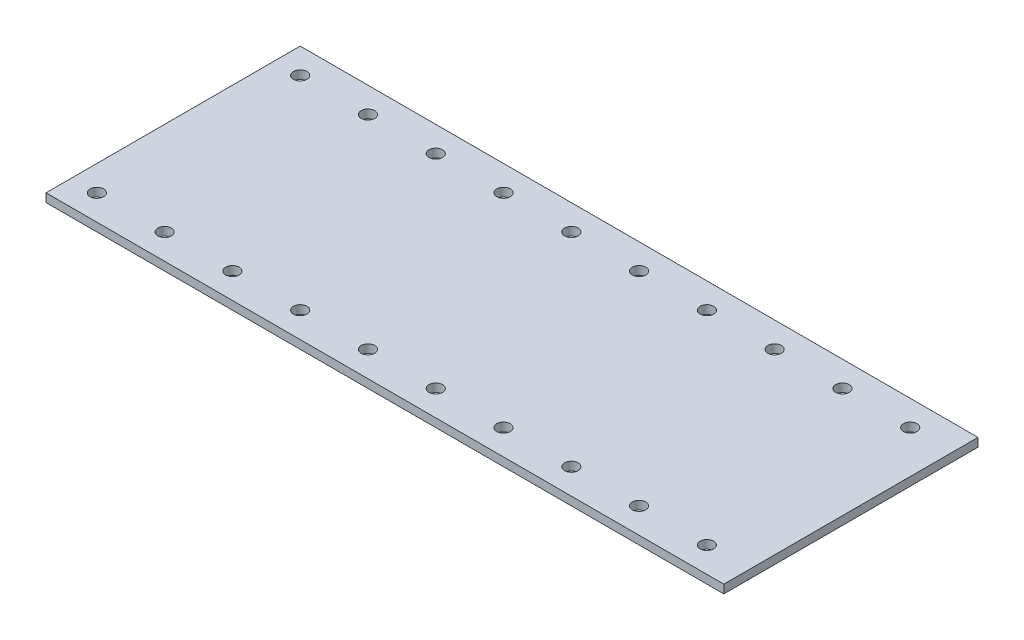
from build123d import *

# Parameters (mm, degrees)
SKETCH1_W                      = 200
SKETCH1_H                      = 75
BOSS_EXTRUDE1_DEPTH            = 2.5
F_4_0MM_DOWEL_HOLE1_AT_2_COUNT = 2
F_4_0MM_DOWEL_HOLE1_AT_2_PITCH = 60
LPATTERN1_COUNT                = 10
LPATTERN1_PITCH                = 20


with BuildPart() as part:
    # Sketch1 → Boss-Extrude1 (new body)
    with BuildSketch(Plane(origin=(0, 0, 0), x_dir=(1, 0, 0), z_dir=(0, 1, 0))):
        Rectangle(SKETCH1_W, SKETCH1_H)
    extrude(amount=BOSS_EXTRUDE1_DEPTH)

    # Sketch4 → 4.0mm Dowel Hole1 (revolve, cut)
    with BuildSketch(Plane(origin=(-92.5, 2.5, -30), x_dir=(0, 0, 1), z_dir=(1, 0, 0))):
        Polygon((0, 0), (0, 2.5), (2.025, 2.5), (2, 2.475), (2, 0), align=None)
    f_4_0mm_dowel_hole1 = revolve(axis=Axis((-92.5, 8.85, -30), (0, -1, 0)), mode=Mode.SUBTRACT)

    # 4.0mm Dowel Hole1 at 2: 4.0mm Dowel Hole1 ×2
    with Locations(*[(0, 0, i * F_4_0MM_DOWEL_HOLE1_AT_2_PITCH) for i in range(1, F_4_0MM_DOWEL_HOLE1_AT_2_COUNT)]):
        add(f_4_0mm_dowel_hole1, mode=Mode.SUBTRACT)

    # LPattern1: 4.0mm Dowel Hole1 ×10
    with Locations(*[(i * LPATTERN1_PITCH, 0, 0) for i in range(1, LPATTERN1_COUNT)]):
        add(f_4_0mm_dowel_hole1, mode=Mode.SUBTRACT)

    # LPattern1 copy 1 sketch → LPattern1 copy 1 (revolve, cut)
    with BuildSketch(Plane(origin=(-72.5, 2.5, 30), x_dir=(0, 0, 1), z_dir=(1, 0, 0))):
        Polygon((0, 0), (0, 2.5), (2.025, 2.5), (2, 2.475), (2, 0), align=None)
    revolve(axis=Axis((-72.5, 8.85, 30), (0, -1, 0)), mode=Mode.SUBTRACT)

    # LPattern1 copy 2 sketch → LPattern1 copy 2 (revolve, cut)
    with BuildSketch(Plane(origin=(-52.5, 2.5, 30), x_dir=(0, 0, 1), z_dir=(1, 0, 0))):
        Polygon((0, 0), (0, 2.5), (2.025, 2.5), (2, 2.475), (2, 0), align=None)
    revolve(axis=Axis((-52.5, 8.85, 30), (0, -1, 0)), mode=Mode.SUBTRACT)

    # LPattern1 copy 3 sketch → LPattern1 copy 3 (revolve, cut)
    with BuildSketch(Plane(origin=(-32.5, 2.5, 30), x_dir=(0, 0, 1), z_dir=(1, 0, 0))):
        Polygon((0, 0), (0, 2.5), (2.025, 2.5), (2, 2.475), (2, 0), align=None)
    revolve(axis=Axis((-32.5, 8.85, 30), (0, -1, 0)), mode=Mode.SUBTRACT)

    # LPattern1 copy 4 sketch → LPattern1 copy 4 (revolve, cut)
    with BuildSketch(Plane(origin=(-12.5, 2.5, 30), x_dir=(0, 0, 1), z_dir=(1, 0, 0))):
        Polygon((0, 0), (0, 2.5), (2.025, 2.5), (2, 2.475), (2, 0), align=None)
    revolve(axis=Axis((-12.5, 8.85, 30), (0, -1, 0)), mode=Mode.SUBTRACT)

    # LPattern1 copy 5 sketch → LPattern1 copy 5 (revolve, cut)
    with BuildSketch(Plane(origin=(7.5, 2.5, 30), x_dir=(0, 0, 1), z_dir=(1, 0, 0))):
        Polygon((0, 0), (0, 2.5), (2.025, 2.5), (2, 2.475), (2, 0), align=None)
    revolve(axis=Axis((7.5, 8.85, 30), (0, -1, 0)), mode=Mode.SUBTRACT)

    # LPattern1 copy 6 sketch → LPattern1 copy 6 (revolve, cut)
    with BuildSketch(Plane(origin=(27.5, 2.5, 30), x_dir=(0, 0, 1), z_dir=(1, 0, 0))):
        Polygon((0, 0), (0, 2.5), (2.025, 2.5), (2, 2.475), (2, 0), align=None)
    revolve(axis=Axis((27.5, 8.85, 30), (0, -1, 0)), mode=Mode.SUBTRACT)

    # LPattern1 copy 7 sketch → LPattern1 copy 7 (revolve, cut)
    with BuildSketch(Plane(origin=(47.5, 2.5, 30), x_dir=(0, 0, 1), z_dir=(1, 0, 0))):
        Polygon((0, 0), (0, 2.5), (2.025, 2.5), (2, 2.475), (2, 0), align=None)
    revolve(axis=Axis((47.5, 8.85, 30), (0, -1, 0)), mode=Mode.SUBTRACT)

    # LPattern1 copy 8 sketch → LPattern1 copy 8 (revolve, cut)
    with BuildSketch(Plane(origin=(67.5, 2.5, 30), x_dir=(0, 0, 1), z_dir=(1, 0, 0))):
        Polygon((0, 0), (0, 2.5), (2.025, 2.5), (2, 2.475), (2, 0), align=None)
    revolve(axis=Axis((67.5, 8.85, 30), (0, -1, 0)), mode=Mode.SUBTRACT)

    # LPattern1 copy 9 sketch → LPattern1 copy 9 (revolve, cut)
    with BuildSketch(Plane(origin=(87.5, 2.5, 30), x_dir=(0, 0, 1), z_dir=(1, 0, 0))):
        Polygon((0, 0), (0, 2.5), (2.025, 2.5), (2, 2.475), (2, 0), align=None)
    revolve(axis=Axis((87.5, 8.85, 30), (0, -1, 0)), mode=Mode.SUBTRACT)


solid = part.part
